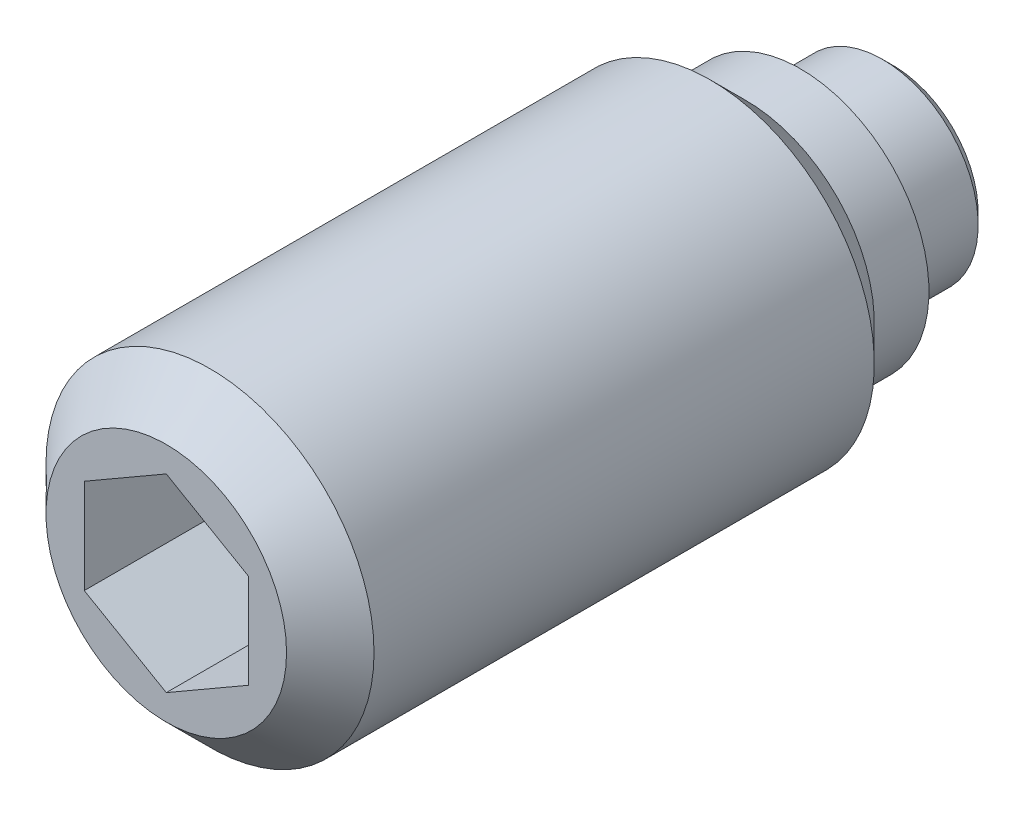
ISO-10303-21;
HEADER;
FILE_DESCRIPTION(('STEP AP214'),'2;1');
FILE_NAME('part.step','',(''),(''),'','','');
FILE_SCHEMA(('AUTOMOTIVE_DESIGN { 1 0 10303 214 1 1 1 1 }'));
ENDSEC;
DATA;
#1=APPLICATION_CONTEXT('core data for automotive mechanical design processes');
#2=APPLICATION_PROTOCOL_DEFINITION('international standard','automotive_design',2000,#1);
#3=PRODUCT_CONTEXT('',#1,'mechanical');
#4=PRODUCT('Part','Part','',(#3));
#5=PRODUCT_RELATED_PRODUCT_CATEGORY('part','',(#4));
#6=PRODUCT_DEFINITION_FORMATION('','',#4);
#7=PRODUCT_DEFINITION_CONTEXT('part definition',#1,'design');
#8=PRODUCT_DEFINITION('design','',#6,#7);
#9=PRODUCT_DEFINITION_SHAPE('','',#8);
#10=(LENGTH_UNIT() NAMED_UNIT(*) SI_UNIT(.MILLI.,.METRE.));
#11=(NAMED_UNIT(*) PLANE_ANGLE_UNIT() SI_UNIT($,.RADIAN.));
#12=(NAMED_UNIT(*) SI_UNIT($,.STERADIAN.) SOLID_ANGLE_UNIT());
#13=UNCERTAINTY_MEASURE_WITH_UNIT(LENGTH_MEASURE(1.E-05),#10,'distance_accuracy_value','');
#14=(GEOMETRIC_REPRESENTATION_CONTEXT(3) GLOBAL_UNCERTAINTY_ASSIGNED_CONTEXT((#13)) GLOBAL_UNIT_ASSIGNED_CONTEXT((#10,
#11,#12)) REPRESENTATION_CONTEXT('',''));
#15=CARTESIAN_POINT('',(0.,0.,0.));
#16=DIRECTION('',(0.,0.,1.));
#17=DIRECTION('',(1.,0.,0.));
#18=AXIS2_PLACEMENT_3D('',#15,#16,#17);
#19=CARTESIAN_POINT('',(0.,0.,0.));
#20=DIRECTION('',(0.,0.,-1.));
#21=DIRECTION('',(-1.,0.,0.));
#22=AXIS2_PLACEMENT_3D('',#19,#20,#21);
#23=CYLINDRICAL_SURFACE('',#22,1.75);
#24=CARTESIAN_POINT('',(0.,0.,0.2));
#25=DIRECTION('',(0.,0.,-1.));
#26=DIRECTION('',(-1.,0.,0.));
#27=AXIS2_PLACEMENT_3D('',#24,#25,#26);
#28=CIRCLE('',#27,1.75);
#29=CARTESIAN_POINT('',(-1.75,0.,0.2));
#30=VERTEX_POINT('',#29);
#31=EDGE_CURVE('E133',#30,#30,#28,.T.);
#32=ORIENTED_EDGE('',*,*,#31,.F.);
#33=EDGE_LOOP('',(#32));
#34=FACE_BOUND('',#33,.T.);
#35=CARTESIAN_POINT('',(0.,0.,1.7));
#36=DIRECTION('',(0.,0.,-1.));
#37=DIRECTION('',(-1.,0.,0.));
#38=AXIS2_PLACEMENT_3D('',#35,#36,#37);
#39=CIRCLE('',#38,1.75);
#40=CARTESIAN_POINT('',(-1.75,0.,1.7));
#41=VERTEX_POINT('',#40);
#42=EDGE_CURVE('E127',#41,#41,#39,.T.);
#43=ORIENTED_EDGE('',*,*,#42,.T.);
#44=EDGE_LOOP('',(#43));
#45=FACE_BOUND('',#44,.T.);
#46=ADVANCED_FACE('F14',(#34,#45),#23,.T.);
#47=CARTESIAN_POINT('',(0.,0.,0.2));
#48=DIRECTION('',(0.,0.,1.));
#49=DIRECTION('',(1.,0.,0.));
#50=AXIS2_PLACEMENT_3D('',#47,#48,#49);
#51=CONICAL_SURFACE('',#50,1.75,0.785398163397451);
#52=CARTESIAN_POINT('',(0.,0.,0.));
#53=DIRECTION('',(0.,0.,-1.));
#54=DIRECTION('',(-1.,0.,0.));
#55=AXIS2_PLACEMENT_3D('',#52,#53,#54);
#56=CIRCLE('',#55,1.55);
#57=CARTESIAN_POINT('',(-1.55,0.,0.));
#58=VERTEX_POINT('',#57);
#59=EDGE_CURVE('E130',#58,#58,#56,.T.);
#60=ORIENTED_EDGE('',*,*,#59,.F.);
#61=EDGE_LOOP('',(#60));
#62=FACE_BOUND('',#61,.T.);
#63=ORIENTED_EDGE('',*,*,#31,.T.);
#64=EDGE_LOOP('',(#63));
#65=FACE_BOUND('',#64,.T.);
#66=ADVANCED_FACE('F159',(#62,#65),#51,.T.);
#67=CARTESIAN_POINT('',(0.,1.55,0.));
#68=DIRECTION('',(0.,0.,1.));
#69=DIRECTION('',(1.,0.,0.));
#70=AXIS2_PLACEMENT_3D('',#67,#68,#69);
#71=PLANE('',#70);
#72=ORIENTED_EDGE('',*,*,#59,.T.);
#73=EDGE_LOOP('',(#72));
#74=FACE_BOUND('',#73,.T.);
#75=ADVANCED_FACE('F165',(#74),#71,.F.);
#76=CARTESIAN_POINT('',(0.,0.,1.7));
#77=DIRECTION('',(0.,0.,-1.));
#78=DIRECTION('',(-1.,0.,0.));
#79=AXIS2_PLACEMENT_3D('',#76,#77,#78);
#80=CYLINDRICAL_SURFACE('',#79,3.);
#81=CARTESIAN_POINT('',(0.,0.,3.35));
#82=DIRECTION('',(0.,0.,-1.));
#83=DIRECTION('',(-1.,0.,0.));
#84=AXIS2_PLACEMENT_3D('',#81,#82,#83);
#85=CIRCLE('',#84,3.);
#86=CARTESIAN_POINT('',(-3.,0.,3.35));
#87=VERTEX_POINT('',#86);
#88=EDGE_CURVE('E9',#87,#87,#85,.T.);
#89=ORIENTED_EDGE('',*,*,#88,.F.);
#90=EDGE_LOOP('',(#89));
#91=FACE_BOUND('',#90,.T.);
#92=CARTESIAN_POINT('',(0.,0.,12.5));
#93=DIRECTION('',(0.,0.,1.));
#94=DIRECTION('',(1.,0.,0.));
#95=AXIS2_PLACEMENT_3D('',#92,#93,#94);
#96=CIRCLE('',#95,3.);
#97=CARTESIAN_POINT('',(3.,0.,12.5));
#98=VERTEX_POINT('',#97);
#99=EDGE_CURVE('E124',#98,#98,#96,.T.);
#100=ORIENTED_EDGE('',*,*,#99,.F.);
#101=EDGE_LOOP('',(#100));
#102=FACE_BOUND('',#101,.T.);
#103=ADVANCED_FACE('F16',(#91,#102),#80,.T.);
#104=CARTESIAN_POINT('',(0.,2.35,1.7));
#105=DIRECTION('',(0.,0.,1.));
#106=DIRECTION('',(1.,0.,0.));
#107=AXIS2_PLACEMENT_3D('',#104,#105,#106);
#108=PLANE('',#107);
#109=CARTESIAN_POINT('',(0.,0.,1.7));
#110=DIRECTION('',(0.,0.,-1.));
#111=DIRECTION('',(-1.,0.,0.));
#112=AXIS2_PLACEMENT_3D('',#109,#110,#111);
#113=CIRCLE('',#112,2.35);
#114=CARTESIAN_POINT('',(-2.35,0.,1.7));
#115=VERTEX_POINT('',#114);
#116=EDGE_CURVE('E136',#115,#115,#113,.T.);
#117=ORIENTED_EDGE('',*,*,#116,.T.);
#118=EDGE_LOOP('',(#117));
#119=FACE_BOUND('',#118,.T.);
#120=ORIENTED_EDGE('',*,*,#42,.F.);
#121=EDGE_LOOP('',(#120));
#122=FACE_BOUND('',#121,.T.);
#123=ADVANCED_FACE('F156',(#119,#122),#108,.F.);
#124=CARTESIAN_POINT('',(0.,0.,1.7));
#125=DIRECTION('',(0.,0.,-1.));
#126=DIRECTION('',(-1.,0.,0.));
#127=AXIS2_PLACEMENT_3D('',#124,#125,#126);
#128=CYLINDRICAL_SURFACE('',#127,2.35);
#129=CARTESIAN_POINT('',(0.,0.,2.7));
#130=DIRECTION('',(0.,0.,-1.));
#131=DIRECTION('',(-1.,0.,0.));
#132=AXIS2_PLACEMENT_3D('',#129,#130,#131);
#133=CIRCLE('',#132,2.35);
#134=CARTESIAN_POINT('',(-2.35,0.,2.7));
#135=VERTEX_POINT('',#134);
#136=EDGE_CURVE('E22',#135,#135,#133,.T.);
#137=ORIENTED_EDGE('',*,*,#136,.T.);
#138=EDGE_LOOP('',(#137));
#139=FACE_BOUND('',#138,.T.);
#140=ORIENTED_EDGE('',*,*,#116,.F.);
#141=EDGE_LOOP('',(#140));
#142=FACE_BOUND('',#141,.T.);
#143=ADVANCED_FACE('F141',(#139,#142),#128,.T.);
#144=CARTESIAN_POINT('',(0.,0.,3.35));
#145=DIRECTION('',(0.,0.,1.));
#146=DIRECTION('',(1.,0.,0.));
#147=AXIS2_PLACEMENT_3D('',#144,#145,#146);
#148=CONICAL_SURFACE('',#147,3.,0.785398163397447);
#149=ORIENTED_EDGE('',*,*,#88,.T.);
#150=EDGE_LOOP('',(#149));
#151=FACE_BOUND('',#150,.T.);
#152=ORIENTED_EDGE('',*,*,#136,.F.);
#153=EDGE_LOOP('',(#152));
#154=FACE_BOUND('',#153,.T.);
#155=ADVANCED_FACE('F144',(#151,#154),#148,.T.);
#156=CARTESIAN_POINT('',(0.,-2.2,13.3));
#157=DIRECTION('',(0.,0.,1.));
#158=DIRECTION('',(1.,0.,0.));
#159=AXIS2_PLACEMENT_3D('',#156,#157,#158);
#160=PLANE('',#159);
#161=DIRECTION('',(0.866025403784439,-0.5,0.));
#162=VECTOR('',#161,1.);
#163=CARTESIAN_POINT('',(-1.5,-0.866025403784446,13.3));
#164=LINE('',#163,#162);
#165=CARTESIAN_POINT('',(-1.5,-0.866025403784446,13.3));
#166=VERTEX_POINT('',#165);
#167=CARTESIAN_POINT('',(0.,-1.73205080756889,13.3));
#168=VERTEX_POINT('',#167);
#169=EDGE_CURVE('E29',#166,#168,#164,.T.);
#170=ORIENTED_EDGE('',*,*,#169,.F.);
#171=DIRECTION('',(0.,-1.,0.));
#172=VECTOR('',#171,1.);
#173=CARTESIAN_POINT('',(-1.5,0.866025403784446,13.3));
#174=LINE('',#173,#172);
#175=CARTESIAN_POINT('',(-1.5,0.866025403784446,13.3));
#176=VERTEX_POINT('',#175);
#177=EDGE_CURVE('E112',#176,#166,#174,.T.);
#178=ORIENTED_EDGE('',*,*,#177,.F.);
#179=DIRECTION('',(-0.866025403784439,-0.5,0.));
#180=VECTOR('',#179,1.);
#181=CARTESIAN_POINT('',(0.,1.73205080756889,13.3));
#182=LINE('',#181,#180);
#183=CARTESIAN_POINT('',(0.,1.73205080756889,13.3));
#184=VERTEX_POINT('',#183);
#185=EDGE_CURVE('E110',#184,#176,#182,.T.);
#186=ORIENTED_EDGE('',*,*,#185,.F.);
#187=DIRECTION('',(-0.866025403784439,0.5,0.));
#188=VECTOR('',#187,1.);
#189=CARTESIAN_POINT('',(1.5,0.866025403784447,13.3));
#190=LINE('',#189,#188);
#191=CARTESIAN_POINT('',(1.5,0.866025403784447,13.3));
#192=VERTEX_POINT('',#191);
#193=EDGE_CURVE('E77',#192,#184,#190,.T.);
#194=ORIENTED_EDGE('',*,*,#193,.F.);
#195=DIRECTION('',(0.,1.,0.));
#196=VECTOR('',#195,1.);
#197=CARTESIAN_POINT('',(1.5,-0.866025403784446,13.3));
#198=LINE('',#197,#196);
#199=CARTESIAN_POINT('',(1.5,-0.866025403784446,13.3));
#200=VERTEX_POINT('',#199);
#201=EDGE_CURVE('E106',#200,#192,#198,.T.);
#202=ORIENTED_EDGE('',*,*,#201,.F.);
#203=DIRECTION('',(0.866025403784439,0.5,0.));
#204=VECTOR('',#203,1.);
#205=CARTESIAN_POINT('',(0.,-1.73205080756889,13.3));
#206=LINE('',#205,#204);
#207=EDGE_CURVE('E103',#168,#200,#206,.T.);
#208=ORIENTED_EDGE('',*,*,#207,.F.);
#209=EDGE_LOOP('',(#170,#178,#186,#194,#202,#208));
#210=FACE_BOUND('',#209,.T.);
#211=CARTESIAN_POINT('',(0.,0.,13.3));
#212=DIRECTION('',(0.,0.,1.));
#213=DIRECTION('',(1.,0.,0.));
#214=AXIS2_PLACEMENT_3D('',#211,#212,#213);
#215=CIRCLE('',#214,2.2);
#216=CARTESIAN_POINT('',(2.2,0.,13.3));
#217=VERTEX_POINT('',#216);
#218=EDGE_CURVE('E116',#217,#217,#215,.T.);
#219=ORIENTED_EDGE('',*,*,#218,.T.);
#220=EDGE_LOOP('',(#219));
#221=FACE_BOUND('',#220,.T.);
#222=ADVANCED_FACE('F146',(#210,#221),#160,.T.);
#223=CARTESIAN_POINT('',(0.,0.,13.3));
#224=DIRECTION('',(0.,0.,-1.));
#225=DIRECTION('',(-1.,0.,0.));
#226=AXIS2_PLACEMENT_3D('',#223,#224,#225);
#227=CONICAL_SURFACE('',#226,2.2,0.785398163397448);
#228=ORIENTED_EDGE('',*,*,#99,.T.);
#229=EDGE_LOOP('',(#228));
#230=FACE_BOUND('',#229,.T.);
#231=ORIENTED_EDGE('',*,*,#218,.F.);
#232=EDGE_LOOP('',(#231));
#233=FACE_BOUND('',#232,.T.);
#234=ADVANCED_FACE('F153',(#230,#233),#227,.T.);
#235=CARTESIAN_POINT('',(-1.5,-0.866025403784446,9.8));
#236=DIRECTION('',(-0.5,-0.866025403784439,0.));
#237=DIRECTION('',(0.866025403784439,-0.5,0.));
#238=AXIS2_PLACEMENT_3D('',#235,#236,#237);
#239=PLANE('',#238);
#240=ORIENTED_EDGE('',*,*,#169,.T.);
#241=DIRECTION('',(0.,0.,1.));
#242=VECTOR('',#241,1.);
#243=CARTESIAN_POINT('',(0.,-1.73205080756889,9.8));
#244=LINE('',#243,#242);
#245=CARTESIAN_POINT('',(0.,-1.73205080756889,9.8));
#246=VERTEX_POINT('',#245);
#247=EDGE_CURVE('E59',#246,#168,#244,.T.);
#248=ORIENTED_EDGE('',*,*,#247,.F.);
#249=DIRECTION('',(0.866025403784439,-0.5,0.));
#250=VECTOR('',#249,1.);
#251=CARTESIAN_POINT('',(-1.5,-0.866025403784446,9.8));
#252=LINE('',#251,#250);
#253=CARTESIAN_POINT('',(-1.5,-0.866025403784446,9.8));
#254=VERTEX_POINT('',#253);
#255=EDGE_CURVE('E114',#254,#246,#252,.T.);
#256=ORIENTED_EDGE('',*,*,#255,.F.);
#257=DIRECTION('',(0.,0.,1.));
#258=VECTOR('',#257,1.);
#259=CARTESIAN_POINT('',(-1.5,-0.866025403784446,9.8));
#260=LINE('',#259,#258);
#261=EDGE_CURVE('E37',#254,#166,#260,.T.);
#262=ORIENTED_EDGE('',*,*,#261,.T.);
#263=EDGE_LOOP('',(#240,#248,#256,#262));
#264=FACE_BOUND('',#263,.T.);
#265=ADVANCED_FACE('F191',(#264),#239,.F.);
#266=CARTESIAN_POINT('',(-1.5,0.866025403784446,9.8));
#267=DIRECTION('',(-1.,0.,0.));
#268=DIRECTION('',(0.,0.,1.));
#269=AXIS2_PLACEMENT_3D('',#266,#267,#268);
#270=PLANE('',#269);
#271=ORIENTED_EDGE('',*,*,#177,.T.);
#272=ORIENTED_EDGE('',*,*,#261,.F.);
#273=DIRECTION('',(0.,-1.,0.));
#274=VECTOR('',#273,1.);
#275=CARTESIAN_POINT('',(-1.5,0.866025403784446,9.8));
#276=LINE('',#275,#274);
#277=CARTESIAN_POINT('',(-1.5,0.866025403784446,9.8));
#278=VERTEX_POINT('',#277);
#279=EDGE_CURVE('E89',#278,#254,#276,.T.);
#280=ORIENTED_EDGE('',*,*,#279,.F.);
#281=DIRECTION('',(0.,0.,1.));
#282=VECTOR('',#281,1.);
#283=CARTESIAN_POINT('',(-1.5,0.866025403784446,9.8));
#284=LINE('',#283,#282);
#285=EDGE_CURVE('E81',#278,#176,#284,.T.);
#286=ORIENTED_EDGE('',*,*,#285,.T.);
#287=EDGE_LOOP('',(#271,#272,#280,#286));
#288=FACE_BOUND('',#287,.T.);
#289=ADVANCED_FACE('F198',(#288),#270,.F.);
#290=CARTESIAN_POINT('',(0.,1.73205080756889,9.8));
#291=DIRECTION('',(-0.5,0.866025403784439,0.));
#292=DIRECTION('',(-0.866025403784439,-0.5,0.));
#293=AXIS2_PLACEMENT_3D('',#290,#291,#292);
#294=PLANE('',#293);
#295=ORIENTED_EDGE('',*,*,#185,.T.);
#296=ORIENTED_EDGE('',*,*,#285,.F.);
#297=DIRECTION('',(-0.866025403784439,-0.5,0.));
#298=VECTOR('',#297,1.);
#299=CARTESIAN_POINT('',(0.,1.73205080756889,9.8));
#300=LINE('',#299,#298);
#301=CARTESIAN_POINT('',(0.,1.73205080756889,9.8));
#302=VERTEX_POINT('',#301);
#303=EDGE_CURVE('E85',#302,#278,#300,.T.);
#304=ORIENTED_EDGE('',*,*,#303,.F.);
#305=DIRECTION('',(0.,0.,1.));
#306=VECTOR('',#305,1.);
#307=CARTESIAN_POINT('',(0.,1.73205080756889,9.8));
#308=LINE('',#307,#306);
#309=EDGE_CURVE('E70',#302,#184,#308,.T.);
#310=ORIENTED_EDGE('',*,*,#309,.T.);
#311=EDGE_LOOP('',(#295,#296,#304,#310));
#312=FACE_BOUND('',#311,.T.);
#313=ADVANCED_FACE('F86',(#312),#294,.F.);
#314=CARTESIAN_POINT('',(1.5,0.866025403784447,9.8));
#315=DIRECTION('',(0.5,0.866025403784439,0.));
#316=DIRECTION('',(-0.866025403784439,0.5,0.));
#317=AXIS2_PLACEMENT_3D('',#314,#315,#316);
#318=PLANE('',#317);
#319=ORIENTED_EDGE('',*,*,#193,.T.);
#320=ORIENTED_EDGE('',*,*,#309,.F.);
#321=DIRECTION('',(-0.866025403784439,0.5,0.));
#322=VECTOR('',#321,1.);
#323=CARTESIAN_POINT('',(1.5,0.866025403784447,9.8));
#324=LINE('',#323,#322);
#325=CARTESIAN_POINT('',(1.5,0.866025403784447,9.8));
#326=VERTEX_POINT('',#325);
#327=EDGE_CURVE('E74',#326,#302,#324,.T.);
#328=ORIENTED_EDGE('',*,*,#327,.F.);
#329=DIRECTION('',(0.,0.,1.));
#330=VECTOR('',#329,1.);
#331=CARTESIAN_POINT('',(1.5,0.866025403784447,9.8));
#332=LINE('',#331,#330);
#333=EDGE_CURVE('E82',#326,#192,#332,.T.);
#334=ORIENTED_EDGE('',*,*,#333,.T.);
#335=EDGE_LOOP('',(#319,#320,#328,#334));
#336=FACE_BOUND('',#335,.T.);
#337=ADVANCED_FACE('F72',(#336),#318,.F.);
#338=CARTESIAN_POINT('',(1.5,-0.866025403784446,9.8));
#339=DIRECTION('',(1.,0.,0.));
#340=DIRECTION('',(0.,1.,0.));
#341=AXIS2_PLACEMENT_3D('',#338,#339,#340);
#342=PLANE('',#341);
#343=ORIENTED_EDGE('',*,*,#201,.T.);
#344=ORIENTED_EDGE('',*,*,#333,.F.);
#345=DIRECTION('',(0.,1.,0.));
#346=VECTOR('',#345,1.);
#347=CARTESIAN_POINT('',(1.5,-0.866025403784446,9.8));
#348=LINE('',#347,#346);
#349=CARTESIAN_POINT('',(1.5,-0.866025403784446,9.8));
#350=VERTEX_POINT('',#349);
#351=EDGE_CURVE('E95',#350,#326,#348,.T.);
#352=ORIENTED_EDGE('',*,*,#351,.F.);
#353=DIRECTION('',(0.,0.,1.));
#354=VECTOR('',#353,1.);
#355=CARTESIAN_POINT('',(1.5,-0.866025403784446,9.8));
#356=LINE('',#355,#354);
#357=EDGE_CURVE('E119',#350,#200,#356,.T.);
#358=ORIENTED_EDGE('',*,*,#357,.T.);
#359=EDGE_LOOP('',(#343,#344,#352,#358));
#360=FACE_BOUND('',#359,.T.);
#361=ADVANCED_FACE('F204',(#360),#342,.F.);
#362=CARTESIAN_POINT('',(0.,-1.73205080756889,9.8));
#363=DIRECTION('',(0.5,-0.866025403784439,0.));
#364=DIRECTION('',(0.866025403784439,0.5,0.));
#365=AXIS2_PLACEMENT_3D('',#362,#363,#364);
#366=PLANE('',#365);
#367=ORIENTED_EDGE('',*,*,#207,.T.);
#368=ORIENTED_EDGE('',*,*,#357,.F.);
#369=DIRECTION('',(0.866025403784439,0.5,0.));
#370=VECTOR('',#369,1.);
#371=CARTESIAN_POINT('',(0.,-1.73205080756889,9.8));
#372=LINE('',#371,#370);
#373=EDGE_CURVE('E97',#246,#350,#372,.T.);
#374=ORIENTED_EDGE('',*,*,#373,.F.);
#375=ORIENTED_EDGE('',*,*,#247,.T.);
#376=EDGE_LOOP('',(#367,#368,#374,#375));
#377=FACE_BOUND('',#376,.T.);
#378=ADVANCED_FACE('F201',(#377),#366,.F.);
#379=CARTESIAN_POINT('',(0.,0.,9.8));
#380=DIRECTION('',(0.,0.,1.));
#381=DIRECTION('',(1.,0.,0.));
#382=AXIS2_PLACEMENT_3D('',#379,#380,#381);
#383=PLANE('',#382);
#384=ORIENTED_EDGE('',*,*,#255,.T.);
#385=ORIENTED_EDGE('',*,*,#373,.T.);
#386=ORIENTED_EDGE('',*,*,#351,.T.);
#387=ORIENTED_EDGE('',*,*,#327,.T.);
#388=ORIENTED_EDGE('',*,*,#303,.T.);
#389=ORIENTED_EDGE('',*,*,#279,.T.);
#390=EDGE_LOOP('',(#384,#385,#386,#387,#388,#389));
#391=FACE_BOUND('',#390,.T.);
#392=ADVANCED_FACE('F92',(#391),#383,.T.);
#393=CLOSED_SHELL('',(#46,#66,#75,#103,#123,#143,#155,#222,#234,#265,#289,#313,#337,#361,#378,#392));
#394=MANIFOLD_SOLID_BREP('B1',#393);
#395=ADVANCED_BREP_SHAPE_REPRESENTATION('',(#18,#394),#14);
#396=SHAPE_DEFINITION_REPRESENTATION(#9,#395);
ENDSEC;
END-ISO-10303-21;
